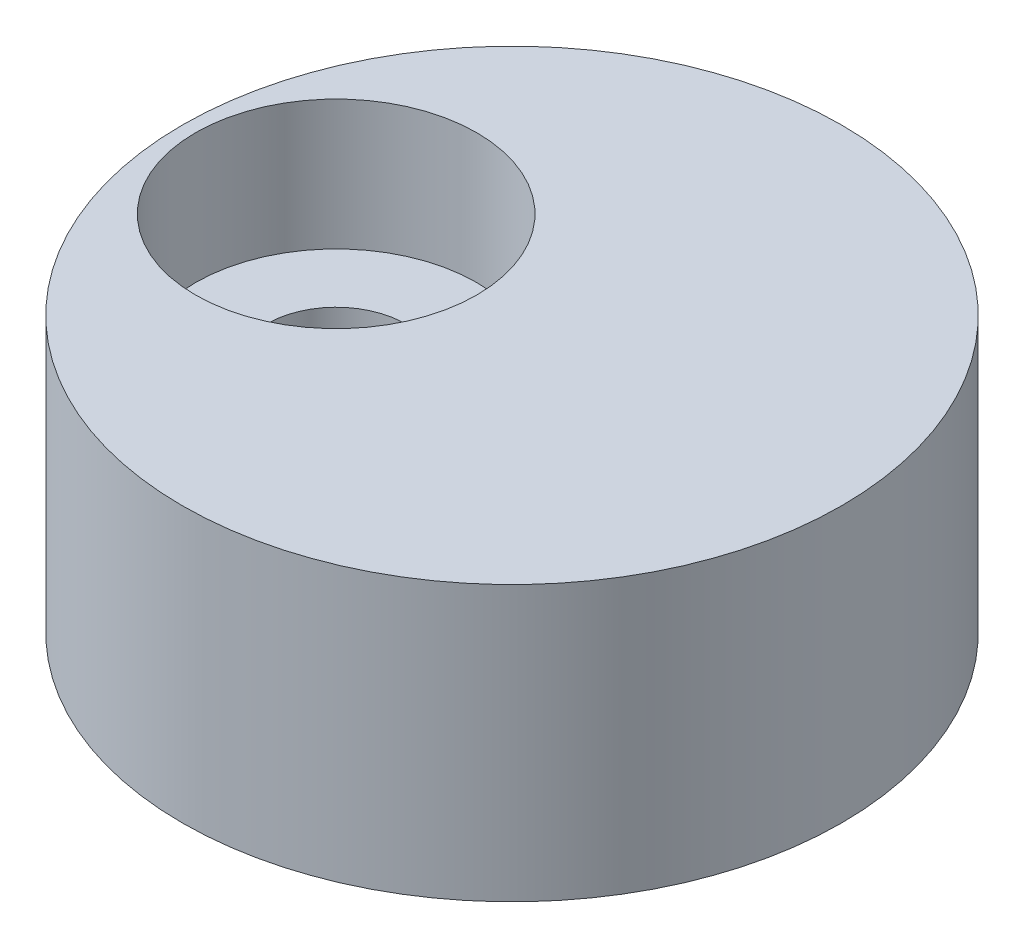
from build123d import *

# Parameters (mm, degrees)
SKETCH1_R                      = 7.62
BOSS_EXTRUDE1_DEPTH            = 6.35
CBORE_FOR_M3_SHCS1_D           = 3.2
CBORE_FOR_M3_SHCS1_CBORE_D     = 6.5
CBORE_FOR_M3_SHCS1_CBORE_DEPTH = 3


with BuildPart() as part:
    # Sketch1 → Boss-Extrude1 (new body)
    with BuildSketch(Plane(origin=(0, 0, 0), x_dir=(1, 0, 0), z_dir=(0, 1, 0))):
        with Locations(Location((0, 0, 0), (0, 0, 270))):
            Circle(SKETCH1_R)
    extrude(amount=BOSS_EXTRUDE1_DEPTH)

    # CBORE for M3 SHCS1 (through all)
    with Locations(Plane(origin=(0, 6.35, 0), x_dir=(-1, 0, 0), z_dir=(0, 1, 0))):
        with Locations((4.064, 0)):
            CounterBoreHole(CBORE_FOR_M3_SHCS1_D / 2, CBORE_FOR_M3_SHCS1_CBORE_D / 2, CBORE_FOR_M3_SHCS1_CBORE_DEPTH)


solid = part.part
